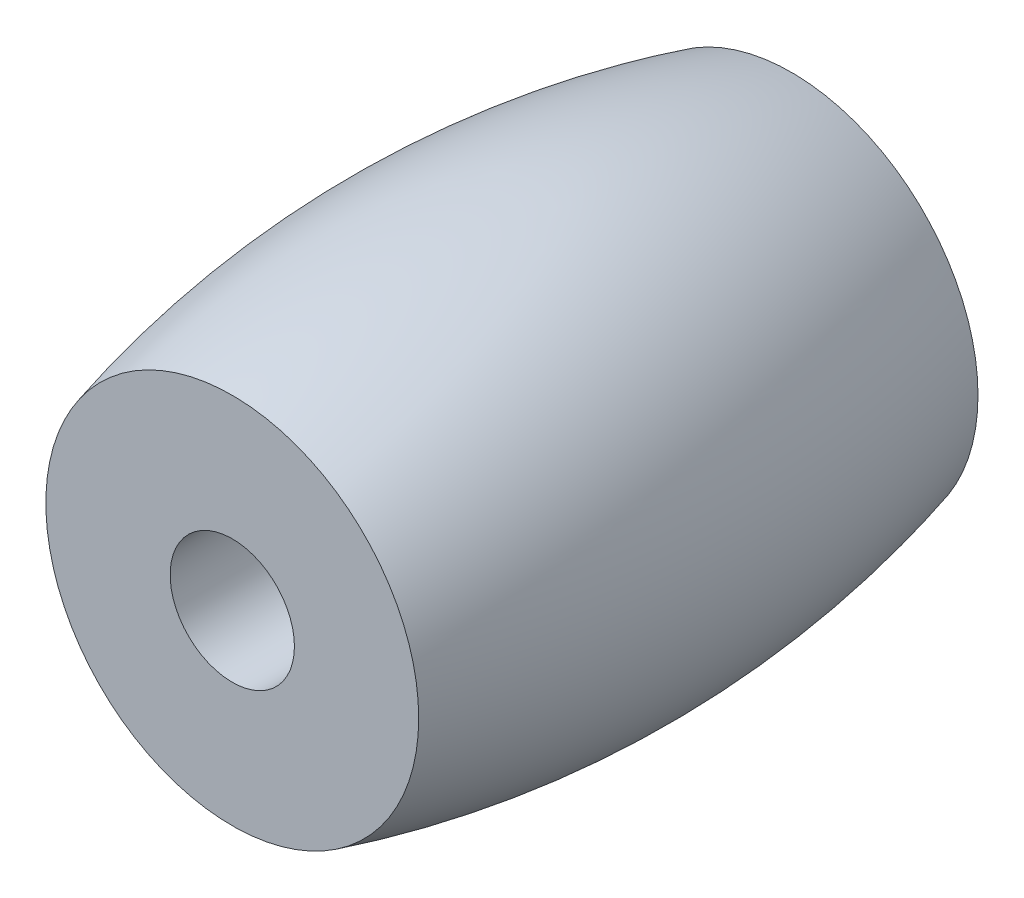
ISO-10303-21;
HEADER;
FILE_DESCRIPTION(('STEP AP214'),'2;1');
FILE_NAME('part.step','',(''),(''),'','','');
FILE_SCHEMA(('AUTOMOTIVE_DESIGN { 1 0 10303 214 1 1 1 1 }'));
ENDSEC;
DATA;
#1=APPLICATION_CONTEXT('core data for automotive mechanical design processes');
#2=APPLICATION_PROTOCOL_DEFINITION('international standard','automotive_design',2000,#1);
#3=PRODUCT_CONTEXT('',#1,'mechanical');
#4=PRODUCT('Part','Part','',(#3));
#5=PRODUCT_RELATED_PRODUCT_CATEGORY('part','',(#4));
#6=PRODUCT_DEFINITION_FORMATION('','',#4);
#7=PRODUCT_DEFINITION_CONTEXT('part definition',#1,'design');
#8=PRODUCT_DEFINITION('design','',#6,#7);
#9=PRODUCT_DEFINITION_SHAPE('','',#8);
#10=(LENGTH_UNIT() NAMED_UNIT(*) SI_UNIT(.MILLI.,.METRE.));
#11=(NAMED_UNIT(*) PLANE_ANGLE_UNIT() SI_UNIT($,.RADIAN.));
#12=(NAMED_UNIT(*) SI_UNIT($,.STERADIAN.) SOLID_ANGLE_UNIT());
#13=UNCERTAINTY_MEASURE_WITH_UNIT(LENGTH_MEASURE(1.E-05),#10,'distance_accuracy_value','');
#14=(GEOMETRIC_REPRESENTATION_CONTEXT(3) GLOBAL_UNCERTAINTY_ASSIGNED_CONTEXT((#13)) GLOBAL_UNIT_ASSIGNED_CONTEXT((#10,
#11,#12)) REPRESENTATION_CONTEXT('',''));
#15=CARTESIAN_POINT('',(0.,0.,0.));
#16=DIRECTION('',(0.,0.,1.));
#17=DIRECTION('',(1.,0.,0.));
#18=AXIS2_PLACEMENT_3D('',#15,#16,#17);
#19=CARTESIAN_POINT('',(0.,0.,0.));
#20=DIRECTION('',(0.,0.,1.));
#21=DIRECTION('',(1.,0.,0.));
#22=AXIS2_PLACEMENT_3D('',#19,#20,#21);
#23=DEGENERATE_TOROIDAL_SURFACE('',#22,20.3624999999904,25.7624999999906,.F.);
#24=CARTESIAN_POINT('',(0.,0.,-6.74999999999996));
#25=DIRECTION('',(0.,0.,1.));
#26=DIRECTION('',(1.,0.,0.));
#27=AXIS2_PLACEMENT_3D('',#24,#25,#26);
#28=CIRCLE('',#27,4.49999999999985);
#29=CARTESIAN_POINT('',(4.49999999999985,0.,-6.74999999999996));
#30=VERTEX_POINT('',#29);
#31=EDGE_CURVE('E10',#30,#30,#28,.T.);
#32=ORIENTED_EDGE('',*,*,#31,.T.);
#33=EDGE_LOOP('',(#32));
#34=FACE_BOUND('',#33,.T.);
#35=CARTESIAN_POINT('',(0.,0.,6.74999999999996));
#36=DIRECTION('',(0.,0.,1.));
#37=DIRECTION('',(1.,0.,0.));
#38=AXIS2_PLACEMENT_3D('',#35,#36,#37);
#39=CIRCLE('',#38,4.49999999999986);
#40=CARTESIAN_POINT('',(4.49999999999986,0.,6.74999999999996));
#41=VERTEX_POINT('',#40);
#42=EDGE_CURVE('E44',#41,#41,#39,.T.);
#43=ORIENTED_EDGE('',*,*,#42,.F.);
#44=EDGE_LOOP('',(#43));
#45=FACE_BOUND('',#44,.T.);
#46=ADVANCED_FACE('F30',(#34,#45),#23,.F.);
#47=CARTESIAN_POINT('',(4.49999999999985,0.,-6.74999999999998));
#48=DIRECTION('',(0.,0.,-1.));
#49=DIRECTION('',(-1.,0.,0.));
#50=AXIS2_PLACEMENT_3D('',#47,#48,#49);
#51=PLANE('',#50);
#52=CARTESIAN_POINT('',(0.,0.,-6.75));
#53=DIRECTION('',(0.,0.,1.));
#54=DIRECTION('',(1.,0.,0.));
#55=AXIS2_PLACEMENT_3D('',#52,#53,#54);
#56=CIRCLE('',#55,1.5);
#57=CARTESIAN_POINT('',(1.5,0.,-6.75));
#58=VERTEX_POINT('',#57);
#59=EDGE_CURVE('E36',#58,#58,#56,.T.);
#60=ORIENTED_EDGE('',*,*,#59,.T.);
#61=EDGE_LOOP('',(#60));
#62=FACE_BOUND('',#61,.T.);
#63=ORIENTED_EDGE('',*,*,#31,.F.);
#64=EDGE_LOOP('',(#63));
#65=FACE_BOUND('',#64,.T.);
#66=ADVANCED_FACE('F54',(#62,#65),#51,.T.);
#67=CARTESIAN_POINT('',(0.,0.,-6.75));
#68=DIRECTION('',(0.,0.,1.));
#69=DIRECTION('',(1.,0.,0.));
#70=AXIS2_PLACEMENT_3D('',#67,#68,#69);
#71=CYLINDRICAL_SURFACE('',#70,1.5);
#72=CARTESIAN_POINT('',(0.,0.,6.75));
#73=DIRECTION('',(0.,0.,1.));
#74=DIRECTION('',(1.,0.,0.));
#75=AXIS2_PLACEMENT_3D('',#72,#73,#74);
#76=CIRCLE('',#75,1.5);
#77=CARTESIAN_POINT('',(1.5,0.,6.75));
#78=VERTEX_POINT('',#77);
#79=EDGE_CURVE('E40',#78,#78,#76,.T.);
#80=ORIENTED_EDGE('',*,*,#79,.T.);
#81=EDGE_LOOP('',(#80));
#82=FACE_BOUND('',#81,.T.);
#83=ORIENTED_EDGE('',*,*,#59,.F.);
#84=EDGE_LOOP('',(#83));
#85=FACE_BOUND('',#84,.T.);
#86=ADVANCED_FACE('F58',(#82,#85),#71,.F.);
#87=CARTESIAN_POINT('',(1.5,0.,6.74999999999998));
#88=DIRECTION('',(0.,0.,1.));
#89=DIRECTION('',(1.,0.,0.));
#90=AXIS2_PLACEMENT_3D('',#87,#88,#89);
#91=PLANE('',#90);
#92=ORIENTED_EDGE('',*,*,#42,.T.);
#93=EDGE_LOOP('',(#92));
#94=FACE_BOUND('',#93,.T.);
#95=ORIENTED_EDGE('',*,*,#79,.F.);
#96=EDGE_LOOP('',(#95));
#97=FACE_BOUND('',#96,.T.);
#98=ADVANCED_FACE('F50',(#94,#97),#91,.T.);
#99=CLOSED_SHELL('',(#46,#66,#86,#98));
#100=MANIFOLD_SOLID_BREP('B2',#99);
#101=ADVANCED_BREP_SHAPE_REPRESENTATION('',(#18,#100),#14);
#102=SHAPE_DEFINITION_REPRESENTATION(#9,#101);
ENDSEC;
END-ISO-10303-21;
